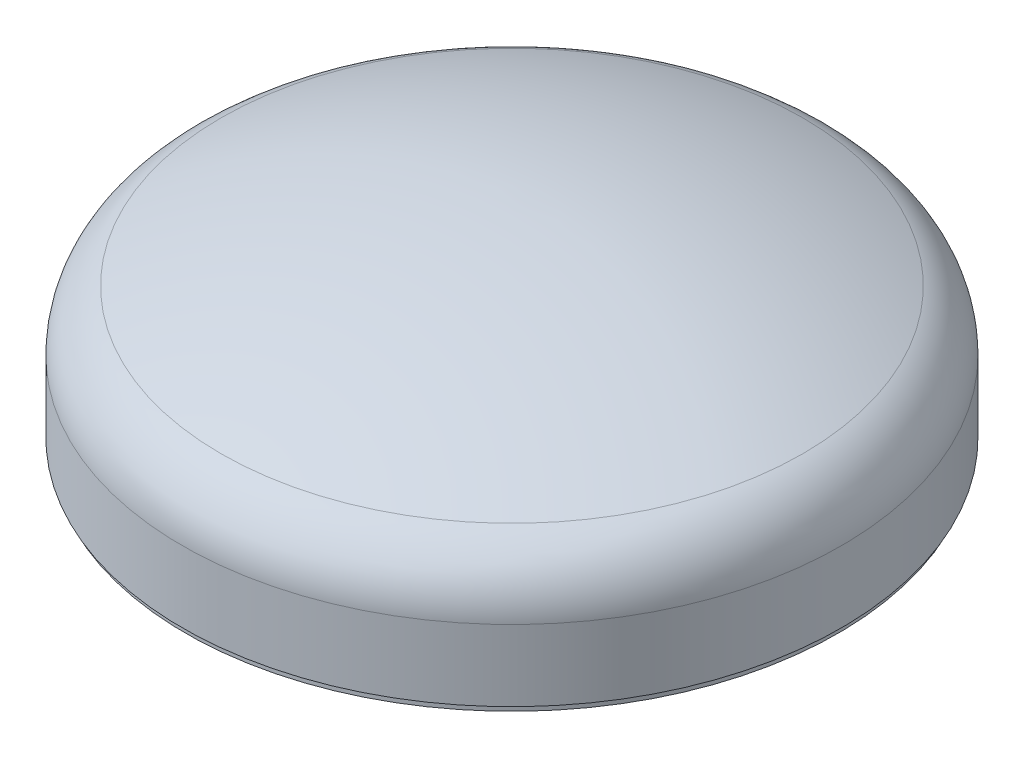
ISO-10303-21;
HEADER;
FILE_DESCRIPTION(('STEP AP214'),'2;1');
FILE_NAME('part.step','',(''),(''),'','','');
FILE_SCHEMA(('AUTOMOTIVE_DESIGN { 1 0 10303 214 1 1 1 1 }'));
ENDSEC;
DATA;
#1=APPLICATION_CONTEXT('core data for automotive mechanical design processes');
#2=APPLICATION_PROTOCOL_DEFINITION('international standard','automotive_design',2000,#1);
#3=PRODUCT_CONTEXT('',#1,'mechanical');
#4=PRODUCT('Part','Part','',(#3));
#5=PRODUCT_RELATED_PRODUCT_CATEGORY('part','',(#4));
#6=PRODUCT_DEFINITION_FORMATION('','',#4);
#7=PRODUCT_DEFINITION_CONTEXT('part definition',#1,'design');
#8=PRODUCT_DEFINITION('design','',#6,#7);
#9=PRODUCT_DEFINITION_SHAPE('','',#8);
#10=(LENGTH_UNIT() NAMED_UNIT(*) SI_UNIT(.MILLI.,.METRE.));
#11=(NAMED_UNIT(*) PLANE_ANGLE_UNIT() SI_UNIT($,.RADIAN.));
#12=(NAMED_UNIT(*) SI_UNIT($,.STERADIAN.) SOLID_ANGLE_UNIT());
#13=UNCERTAINTY_MEASURE_WITH_UNIT(LENGTH_MEASURE(1.E-05),#10,'distance_accuracy_value','');
#14=(GEOMETRIC_REPRESENTATION_CONTEXT(3) GLOBAL_UNCERTAINTY_ASSIGNED_CONTEXT((#13)) GLOBAL_UNIT_ASSIGNED_CONTEXT((#10,
#11,#12)) REPRESENTATION_CONTEXT('',''));
#15=CARTESIAN_POINT('',(0.,0.,0.));
#16=DIRECTION('',(0.,0.,1.));
#17=DIRECTION('',(1.,0.,0.));
#18=AXIS2_PLACEMENT_3D('',#15,#16,#17);
#19=CARTESIAN_POINT('',(0.,0.,0.));
#20=DIRECTION('',(0.,-1.,0.));
#21=DIRECTION('',(1.,0.,0.));
#22=AXIS2_PLACEMENT_3D('',#19,#20,#21);
#23=SPHERICAL_SURFACE('',#22,1100.);
#24=CARTESIAN_POINT('',(0.,999.24594180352,0.));
#25=DIRECTION('',(0.,-1.,0.));
#26=DIRECTION('',(0.,0.,-1.));
#27=AXIS2_PLACEMENT_3D('',#24,#25,#26);
#28=CIRCLE('',#27,459.899497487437);
#29=CARTESIAN_POINT('',(0.,999.24594180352,-459.899497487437));
#30=VERTEX_POINT('',#29);
#31=EDGE_CURVE('E71',#30,#30,#28,.T.);
#32=ORIENTED_EDGE('',*,*,#31,.F.);
#33=EDGE_LOOP('',(#32));
#34=FACE_BOUND('',#33,.T.);
#35=ADVANCED_FACE('F34',(#34),#23,.T.);
#36=CARTESIAN_POINT('',(0.,0.,0.));
#37=DIRECTION('',(0.,-1.,0.));
#38=DIRECTION('',(1.,0.,0.));
#39=AXIS2_PLACEMENT_3D('',#36,#37,#38);
#40=SPHERICAL_SURFACE('',#39,1094.);
#41=CARTESIAN_POINT('',(0.,995.859022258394,0.));
#42=DIRECTION('',(0.,-1.,0.));
#43=DIRECTION('',(0.,0.,-1.));
#44=AXIS2_PLACEMENT_3D('',#41,#42,#43);
#45=CIRCLE('',#44,452.880566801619);
#46=CARTESIAN_POINT('',(0.,995.859022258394,-452.880566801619));
#47=VERTEX_POINT('',#46);
#48=EDGE_CURVE('E10',#47,#47,#45,.T.);
#49=ORIENTED_EDGE('',*,*,#48,.T.);
#50=EDGE_LOOP('',(#49));
#51=FACE_BOUND('',#50,.T.);
#52=ADVANCED_FACE('F78',(#51),#40,.F.);
#53=CARTESIAN_POINT('',(0.,899.368111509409,0.));
#54=DIRECTION('',(0.,-1.,0.));
#55=DIRECTION('',(0.,0.,-1.));
#56=AXIS2_PLACEMENT_3D('',#53,#54,#55);
#57=TOROIDAL_SURFACE('',#56,409.,106.);
#58=CARTESIAN_POINT('',(0.,899.368111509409,0.));
#59=DIRECTION('',(0.,-1.,0.));
#60=DIRECTION('',(0.,0.,-1.));
#61=AXIS2_PLACEMENT_3D('',#58,#59,#60);
#62=CIRCLE('',#61,515.);
#63=CARTESIAN_POINT('',(0.,899.368111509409,-515.));
#64=VERTEX_POINT('',#63);
#65=EDGE_CURVE('E40',#64,#64,#62,.T.);
#66=ORIENTED_EDGE('',*,*,#65,.T.);
#67=EDGE_LOOP('',(#66));
#68=FACE_BOUND('',#67,.T.);
#69=ORIENTED_EDGE('',*,*,#48,.F.);
#70=EDGE_LOOP('',(#69));
#71=FACE_BOUND('',#70,.T.);
#72=ADVANCED_FACE('F82',(#68,#71),#57,.F.);
#73=CARTESIAN_POINT('',(0.,0.,0.));
#74=DIRECTION('',(0.,-1.,0.));
#75=DIRECTION('',(0.,0.,-1.));
#76=AXIS2_PLACEMENT_3D('',#73,#74,#75);
#77=CYLINDRICAL_SURFACE('',#76,515.);
#78=CARTESIAN_POINT('',(0.,793.374314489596,0.));
#79=DIRECTION('',(0.,-1.,0.));
#80=DIRECTION('',(0.,0.,-1.));
#81=AXIS2_PLACEMENT_3D('',#78,#79,#80);
#82=CIRCLE('',#81,515.);
#83=CARTESIAN_POINT('',(0.,793.374314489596,-515.));
#84=VERTEX_POINT('',#83);
#85=EDGE_CURVE('E44',#84,#84,#82,.T.);
#86=ORIENTED_EDGE('',*,*,#85,.T.);
#87=EDGE_LOOP('',(#86));
#88=FACE_BOUND('',#87,.T.);
#89=ORIENTED_EDGE('',*,*,#65,.F.);
#90=EDGE_LOOP('',(#89));
#91=FACE_BOUND('',#90,.T.);
#92=ADVANCED_FACE('F86',(#88,#91),#77,.F.);
#93=CARTESIAN_POINT('',(0.,791.240339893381,0.));
#94=DIRECTION('',(0.,1.,0.));
#95=DIRECTION('',(0.,0.,1.));
#96=AXIS2_PLACEMENT_3D('',#93,#94,#95);
#97=CONICAL_SURFACE('',#96,511.303847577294,1.04719755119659);
#98=ORIENTED_EDGE('',*,*,#85,.F.);
#99=EDGE_LOOP('',(#98));
#100=FACE_BOUND('',#99,.T.);
#101=CARTESIAN_POINT('',(0.,791.240339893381,0.));
#102=DIRECTION('',(0.,-1.,0.));
#103=DIRECTION('',(0.,0.,-1.));
#104=AXIS2_PLACEMENT_3D('',#101,#102,#103);
#105=CIRCLE('',#104,511.303847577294);
#106=CARTESIAN_POINT('',(0.,791.240339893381,-511.303847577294));
#107=VERTEX_POINT('',#106);
#108=EDGE_CURVE('E48',#107,#107,#105,.T.);
#109=ORIENTED_EDGE('',*,*,#108,.T.);
#110=EDGE_LOOP('',(#109));
#111=FACE_BOUND('',#110,.T.);
#112=ADVANCED_FACE('F91',(#100,#111),#97,.F.);
#113=CARTESIAN_POINT('',(0.,788.642263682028,0.));
#114=DIRECTION('',(0.,-1.,0.));
#115=DIRECTION('',(0.,0.,-1.));
#116=AXIS2_PLACEMENT_3D('',#113,#114,#115);
#117=TOROIDAL_SURFACE('',#116,512.803847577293,2.99999999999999);
#118=ORIENTED_EDGE('',*,*,#108,.F.);
#119=EDGE_LOOP('',(#118));
#120=FACE_BOUND('',#119,.T.);
#121=CARTESIAN_POINT('',(0.,788.642263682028,0.));
#122=DIRECTION('',(0.,-1.,0.));
#123=DIRECTION('',(0.,0.,-1.));
#124=AXIS2_PLACEMENT_3D('',#121,#122,#123);
#125=CIRCLE('',#124,509.803847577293);
#126=CARTESIAN_POINT('',(0.,788.642263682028,-509.803847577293));
#127=VERTEX_POINT('',#126);
#128=EDGE_CURVE('E53',#127,#127,#125,.T.);
#129=ORIENTED_EDGE('',*,*,#128,.T.);
#130=EDGE_LOOP('',(#129));
#131=FACE_BOUND('',#130,.T.);
#132=ADVANCED_FACE('F95',(#120,#131),#117,.T.);
#133=CARTESIAN_POINT('',(0.,0.,0.));
#134=DIRECTION('',(0.,-1.,0.));
#135=DIRECTION('',(0.,0.,-1.));
#136=AXIS2_PLACEMENT_3D('',#133,#134,#135);
#137=CYLINDRICAL_SURFACE('',#136,509.803847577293);
#138=ORIENTED_EDGE('',*,*,#128,.F.);
#139=EDGE_LOOP('',(#138));
#140=FACE_BOUND('',#139,.T.);
#141=CARTESIAN_POINT('',(0.,781.374314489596,0.));
#142=DIRECTION('',(0.,-1.,0.));
#143=DIRECTION('',(0.,0.,-1.));
#144=AXIS2_PLACEMENT_3D('',#141,#142,#143);
#145=CIRCLE('',#144,509.803847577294);
#146=CARTESIAN_POINT('',(0.,781.374314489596,-509.803847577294));
#147=VERTEX_POINT('',#146);
#148=EDGE_CURVE('E56',#147,#147,#145,.T.);
#149=ORIENTED_EDGE('',*,*,#148,.T.);
#150=EDGE_LOOP('',(#149));
#151=FACE_BOUND('',#150,.T.);
#152=ADVANCED_FACE('F99',(#140,#151),#137,.F.);
#153=CARTESIAN_POINT('',(515.803847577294,781.374314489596,0.));
#154=DIRECTION('',(0.,1.,0.));
#155=DIRECTION('',(0.,0.,1.));
#156=AXIS2_PLACEMENT_3D('',#153,#154,#155);
#157=PLANE('',#156);
#158=ORIENTED_EDGE('',*,*,#148,.F.);
#159=EDGE_LOOP('',(#158));
#160=FACE_BOUND('',#159,.T.);
#161=CARTESIAN_POINT('',(0.,781.374314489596,0.));
#162=DIRECTION('',(0.,-1.,0.));
#163=DIRECTION('',(0.,0.,-1.));
#164=AXIS2_PLACEMENT_3D('',#161,#162,#163);
#165=CIRCLE('',#164,515.803847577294);
#166=CARTESIAN_POINT('',(0.,781.374314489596,-515.803847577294));
#167=VERTEX_POINT('',#166);
#168=EDGE_CURVE('E59',#167,#167,#165,.T.);
#169=ORIENTED_EDGE('',*,*,#168,.T.);
#170=EDGE_LOOP('',(#169));
#171=FACE_BOUND('',#170,.T.);
#172=ADVANCED_FACE('F103',(#160,#171),#157,.F.);
#173=CARTESIAN_POINT('',(0.,0.,0.));
#174=DIRECTION('',(0.,-1.,0.));
#175=DIRECTION('',(0.,0.,-1.));
#176=AXIS2_PLACEMENT_3D('',#173,#174,#175);
#177=CYLINDRICAL_SURFACE('',#176,515.803847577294);
#178=ORIENTED_EDGE('',*,*,#168,.F.);
#179=EDGE_LOOP('',(#178));
#180=FACE_BOUND('',#179,.T.);
#181=CARTESIAN_POINT('',(0.,788.374314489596,0.));
#182=DIRECTION('',(0.,-1.,0.));
#183=DIRECTION('',(0.,0.,-1.));
#184=AXIS2_PLACEMENT_3D('',#181,#182,#183);
#185=CIRCLE('',#184,515.803847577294);
#186=CARTESIAN_POINT('',(0.,788.374314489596,-515.803847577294));
#187=VERTEX_POINT('',#186);
#188=EDGE_CURVE('E62',#187,#187,#185,.T.);
#189=ORIENTED_EDGE('',*,*,#188,.T.);
#190=EDGE_LOOP('',(#189));
#191=FACE_BOUND('',#190,.T.);
#192=ADVANCED_FACE('F107',(#180,#191),#177,.T.);
#193=CARTESIAN_POINT('',(0.,791.374314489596,0.));
#194=DIRECTION('',(0.,1.,0.));
#195=DIRECTION('',(0.,0.,1.));
#196=AXIS2_PLACEMENT_3D('',#193,#194,#195);
#197=CONICAL_SURFACE('',#196,521.,1.04719755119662);
#198=ORIENTED_EDGE('',*,*,#188,.F.);
#199=EDGE_LOOP('',(#198));
#200=FACE_BOUND('',#199,.T.);
#201=CARTESIAN_POINT('',(0.,791.374314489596,0.));
#202=DIRECTION('',(0.,-1.,0.));
#203=DIRECTION('',(0.,0.,-1.));
#204=AXIS2_PLACEMENT_3D('',#201,#202,#203);
#205=CIRCLE('',#204,521.);
#206=CARTESIAN_POINT('',(0.,791.374314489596,-521.));
#207=VERTEX_POINT('',#206);
#208=EDGE_CURVE('E65',#207,#207,#205,.T.);
#209=ORIENTED_EDGE('',*,*,#208,.T.);
#210=EDGE_LOOP('',(#209));
#211=FACE_BOUND('',#210,.T.);
#212=ADVANCED_FACE('F111',(#200,#211),#197,.T.);
#213=CARTESIAN_POINT('',(0.,0.,0.));
#214=DIRECTION('',(0.,-1.,0.));
#215=DIRECTION('',(0.,0.,-1.));
#216=AXIS2_PLACEMENT_3D('',#213,#214,#215);
#217=CYLINDRICAL_SURFACE('',#216,521.);
#218=ORIENTED_EDGE('',*,*,#208,.F.);
#219=EDGE_LOOP('',(#218));
#220=FACE_BOUND('',#219,.T.);
#221=CARTESIAN_POINT('',(0.,903.863374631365,0.));
#222=DIRECTION('',(0.,-1.,0.));
#223=DIRECTION('',(0.,0.,-1.));
#224=AXIS2_PLACEMENT_3D('',#221,#222,#223);
#225=CIRCLE('',#224,521.);
#226=CARTESIAN_POINT('',(0.,903.863374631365,-521.));
#227=VERTEX_POINT('',#226);
#228=EDGE_CURVE('E68',#227,#227,#225,.T.);
#229=ORIENTED_EDGE('',*,*,#228,.T.);
#230=EDGE_LOOP('',(#229));
#231=FACE_BOUND('',#230,.T.);
#232=ADVANCED_FACE('F115',(#220,#231),#217,.T.);
#233=CARTESIAN_POINT('',(0.,903.863374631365,0.));
#234=DIRECTION('',(0.,-1.,0.));
#235=DIRECTION('',(0.,0.,-1.));
#236=AXIS2_PLACEMENT_3D('',#233,#234,#235);
#237=TOROIDAL_SURFACE('',#236,416.,105.);
#238=ORIENTED_EDGE('',*,*,#228,.F.);
#239=EDGE_LOOP('',(#238));
#240=FACE_BOUND('',#239,.T.);
#241=ORIENTED_EDGE('',*,*,#31,.T.);
#242=EDGE_LOOP('',(#241));
#243=FACE_BOUND('',#242,.T.);
#244=ADVANCED_FACE('F75',(#240,#243),#237,.T.);
#245=CLOSED_SHELL('',(#35,#52,#72,#92,#112,#132,#152,#172,#192,#212,#232,#244));
#246=MANIFOLD_SOLID_BREP('B2',#245);
#247=ADVANCED_BREP_SHAPE_REPRESENTATION('',(#18,#246),#14);
#248=SHAPE_DEFINITION_REPRESENTATION(#9,#247);
ENDSEC;
END-ISO-10303-21;
